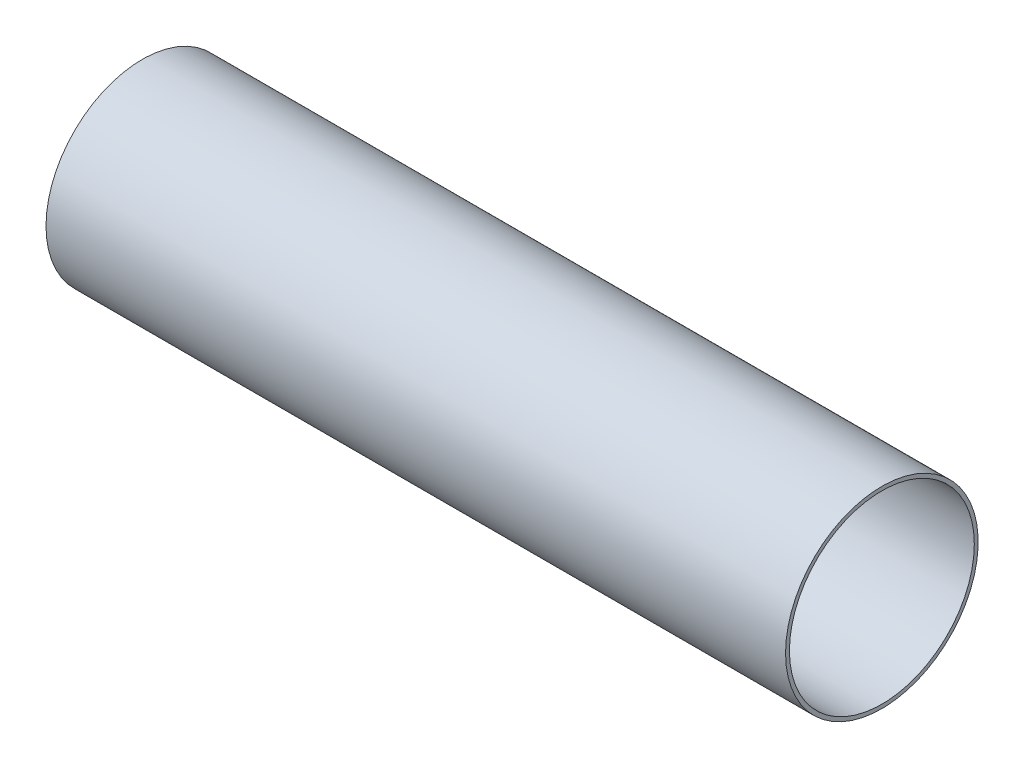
ISO-10303-21;
HEADER;
FILE_DESCRIPTION(('STEP AP214'),'2;1');
FILE_NAME('part.step','',(''),(''),'','','');
FILE_SCHEMA(('AUTOMOTIVE_DESIGN { 1 0 10303 214 1 1 1 1 }'));
ENDSEC;
DATA;
#1=APPLICATION_CONTEXT('core data for automotive mechanical design processes');
#2=APPLICATION_PROTOCOL_DEFINITION('international standard','automotive_design',2000,#1);
#3=PRODUCT_CONTEXT('',#1,'mechanical');
#4=PRODUCT('Part','Part','',(#3));
#5=PRODUCT_RELATED_PRODUCT_CATEGORY('part','',(#4));
#6=PRODUCT_DEFINITION_FORMATION('','',#4);
#7=PRODUCT_DEFINITION_CONTEXT('part definition',#1,'design');
#8=PRODUCT_DEFINITION('design','',#6,#7);
#9=PRODUCT_DEFINITION_SHAPE('','',#8);
#10=(LENGTH_UNIT() NAMED_UNIT(*) SI_UNIT(.MILLI.,.METRE.));
#11=(NAMED_UNIT(*) PLANE_ANGLE_UNIT() SI_UNIT($,.RADIAN.));
#12=(NAMED_UNIT(*) SI_UNIT($,.STERADIAN.) SOLID_ANGLE_UNIT());
#13=UNCERTAINTY_MEASURE_WITH_UNIT(LENGTH_MEASURE(1.E-05),#10,'distance_accuracy_value','');
#14=(GEOMETRIC_REPRESENTATION_CONTEXT(3) GLOBAL_UNCERTAINTY_ASSIGNED_CONTEXT((#13)) GLOBAL_UNIT_ASSIGNED_CONTEXT((#10,
#11,#12)) REPRESENTATION_CONTEXT('',''));
#15=CARTESIAN_POINT('',(0.,0.,0.));
#16=DIRECTION('',(0.,0.,1.));
#17=DIRECTION('',(1.,0.,0.));
#18=AXIS2_PLACEMENT_3D('',#15,#16,#17);
#19=CARTESIAN_POINT('',(304.8,0.,0.));
#20=DIRECTION('',(1.,0.,0.));
#21=DIRECTION('',(0.,0.,-1.));
#22=AXIS2_PLACEMENT_3D('',#19,#20,#21);
#23=PLANE('',#22);
#24=CARTESIAN_POINT('',(304.8,0.,0.));
#25=DIRECTION('',(1.,0.,0.));
#26=DIRECTION('',(0.,0.,-1.));
#27=AXIS2_PLACEMENT_3D('',#24,#25,#26);
#28=CIRCLE('',#27,39.6875);
#29=CARTESIAN_POINT('',(304.8,0.,39.6875));
#30=VERTEX_POINT('',#29);
#31=EDGE_CURVE('E10',#30,#30,#28,.T.);
#32=ORIENTED_EDGE('',*,*,#31,.T.);
#33=EDGE_LOOP('',(#32));
#34=FACE_BOUND('',#33,.T.);
#35=CARTESIAN_POINT('',(304.8,0.,0.));
#36=DIRECTION('',(1.,0.,0.));
#37=DIRECTION('',(0.,0.,-1.));
#38=AXIS2_PLACEMENT_3D('',#35,#36,#37);
#39=CIRCLE('',#38,38.1);
#40=CARTESIAN_POINT('',(304.8,0.,38.1));
#41=VERTEX_POINT('',#40);
#42=EDGE_CURVE('E39',#41,#41,#39,.T.);
#43=ORIENTED_EDGE('',*,*,#42,.F.);
#44=EDGE_LOOP('',(#43));
#45=FACE_BOUND('',#44,.T.);
#46=ADVANCED_FACE('F28',(#34,#45),#23,.T.);
#47=CARTESIAN_POINT('',(0.,0.,0.));
#48=DIRECTION('',(1.,0.,0.));
#49=DIRECTION('',(0.,0.,-1.));
#50=AXIS2_PLACEMENT_3D('',#47,#48,#49);
#51=PLANE('',#50);
#52=CARTESIAN_POINT('',(0.,0.,0.));
#53=DIRECTION('',(1.,0.,0.));
#54=DIRECTION('',(0.,0.,-1.));
#55=AXIS2_PLACEMENT_3D('',#52,#53,#54);
#56=CIRCLE('',#55,39.6875);
#57=CARTESIAN_POINT('',(0.,0.,39.6875));
#58=VERTEX_POINT('',#57);
#59=EDGE_CURVE('E35',#58,#58,#56,.T.);
#60=ORIENTED_EDGE('',*,*,#59,.F.);
#61=EDGE_LOOP('',(#60));
#62=FACE_BOUND('',#61,.T.);
#63=CARTESIAN_POINT('',(0.,0.,0.));
#64=DIRECTION('',(1.,0.,0.));
#65=DIRECTION('',(0.,0.,-1.));
#66=AXIS2_PLACEMENT_3D('',#63,#64,#65);
#67=CIRCLE('',#66,38.1);
#68=CARTESIAN_POINT('',(0.,0.,38.1));
#69=VERTEX_POINT('',#68);
#70=EDGE_CURVE('E43',#69,#69,#67,.T.);
#71=ORIENTED_EDGE('',*,*,#70,.T.);
#72=EDGE_LOOP('',(#71));
#73=FACE_BOUND('',#72,.T.);
#74=ADVANCED_FACE('F49',(#62,#73),#51,.F.);
#75=CARTESIAN_POINT('',(304.8,0.,0.));
#76=DIRECTION('',(-1.,0.,0.));
#77=DIRECTION('',(0.,0.,1.));
#78=AXIS2_PLACEMENT_3D('',#75,#76,#77);
#79=CYLINDRICAL_SURFACE('',#78,39.6875);
#80=CARTESIAN_POINT('',(304.8,0.,39.6875));
#81=CARTESIAN_POINT('',(301.625,0.,39.6875));
#82=CARTESIAN_POINT('',(298.45,0.,39.6875));
#83=CARTESIAN_POINT('',(292.1,0.,39.6875));
#84=CARTESIAN_POINT('',(288.925,0.,39.6875));
#85=CARTESIAN_POINT('',(282.575,0.,39.6875));
#86=CARTESIAN_POINT('',(279.4,0.,39.6875));
#87=CARTESIAN_POINT('',(273.05,0.,39.6875));
#88=CARTESIAN_POINT('',(269.875,0.,39.6875));
#89=CARTESIAN_POINT('',(263.525,0.,39.6875));
#90=CARTESIAN_POINT('',(260.35,0.,39.6875));
#91=CARTESIAN_POINT('',(254.,0.,39.6875));
#92=CARTESIAN_POINT('',(250.825,0.,39.6875));
#93=CARTESIAN_POINT('',(244.475,0.,39.6875));
#94=CARTESIAN_POINT('',(241.3,0.,39.6875));
#95=CARTESIAN_POINT('',(234.95,0.,39.6875));
#96=CARTESIAN_POINT('',(231.775,0.,39.6875));
#97=CARTESIAN_POINT('',(225.425,0.,39.6875));
#98=CARTESIAN_POINT('',(222.25,0.,39.6875));
#99=CARTESIAN_POINT('',(215.9,0.,39.6875));
#100=CARTESIAN_POINT('',(212.725,0.,39.6875));
#101=CARTESIAN_POINT('',(206.375,0.,39.6875));
#102=CARTESIAN_POINT('',(203.2,0.,39.6875));
#103=CARTESIAN_POINT('',(196.85,0.,39.6875));
#104=CARTESIAN_POINT('',(193.675,0.,39.6875));
#105=CARTESIAN_POINT('',(187.325,0.,39.6875));
#106=CARTESIAN_POINT('',(184.15,0.,39.6875));
#107=CARTESIAN_POINT('',(177.8,0.,39.6875));
#108=CARTESIAN_POINT('',(174.625,0.,39.6875));
#109=CARTESIAN_POINT('',(168.275,0.,39.6875));
#110=CARTESIAN_POINT('',(165.1,0.,39.6875));
#111=CARTESIAN_POINT('',(158.75,0.,39.6875));
#112=CARTESIAN_POINT('',(155.575,0.,39.6875));
#113=CARTESIAN_POINT('',(149.225,0.,39.6875));
#114=CARTESIAN_POINT('',(146.05,0.,39.6875));
#115=CARTESIAN_POINT('',(139.7,0.,39.6875));
#116=CARTESIAN_POINT('',(136.525,0.,39.6875));
#117=CARTESIAN_POINT('',(130.175,0.,39.6875));
#118=CARTESIAN_POINT('',(127.,0.,39.6875));
#119=CARTESIAN_POINT('',(120.65,0.,39.6875));
#120=CARTESIAN_POINT('',(117.475,0.,39.6875));
#121=CARTESIAN_POINT('',(111.125,0.,39.6875));
#122=CARTESIAN_POINT('',(107.95,0.,39.6875));
#123=CARTESIAN_POINT('',(101.6,0.,39.6875));
#124=CARTESIAN_POINT('',(98.425,0.,39.6875));
#125=CARTESIAN_POINT('',(92.075,0.,39.6875));
#126=CARTESIAN_POINT('',(88.9,0.,39.6875));
#127=CARTESIAN_POINT('',(82.55,0.,39.6875));
#128=CARTESIAN_POINT('',(79.375,0.,39.6875));
#129=CARTESIAN_POINT('',(73.025,0.,39.6875));
#130=CARTESIAN_POINT('',(69.85,0.,39.6875));
#131=CARTESIAN_POINT('',(63.5,0.,39.6875));
#132=CARTESIAN_POINT('',(60.325,0.,39.6875));
#133=CARTESIAN_POINT('',(53.975,0.,39.6875));
#134=CARTESIAN_POINT('',(50.8,0.,39.6875));
#135=CARTESIAN_POINT('',(44.45,0.,39.6875));
#136=CARTESIAN_POINT('',(41.275,0.,39.6875));
#137=CARTESIAN_POINT('',(34.925,0.,39.6875));
#138=CARTESIAN_POINT('',(31.75,0.,39.6875));
#139=CARTESIAN_POINT('',(25.4,0.,39.6875));
#140=CARTESIAN_POINT('',(22.225,0.,39.6875));
#141=CARTESIAN_POINT('',(15.875,0.,39.6875));
#142=CARTESIAN_POINT('',(12.7,0.,39.6875));
#143=CARTESIAN_POINT('',(6.35,0.,39.6875));
#144=CARTESIAN_POINT('',(3.175,0.,39.6875));
#145=CARTESIAN_POINT('',(0.,0.,39.6875));
#146=B_SPLINE_CURVE_WITH_KNOTS('',3,(#80,#81,#82,#83,#84,#85,#86,#87,#88,#89,#90,#91,#92,#93,
#94,#95,#96,#97,#98,#99,#100,#101,#102,#103,#104,#105,#106,#107,#108,#109,#110,#111,#112,#113,
#114,#115,#116,#117,#118,#119,#120,#121,#122,#123,#124,#125,#126,#127,#128,#129,#130,#131,#132,
#133,#134,#135,#136,#137,#138,#139,#140,#141,#142,#143,#144,#145),.UNSPECIFIED.,.F.,.F.,(4,2,2,
2,2,2,2,2,2,2,2,2,2,2,2,2,2,2,2,2,2,2,2,2,2,2,2,2,2,2,2,2,4),(0.,9.52499999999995,19.05,28.575,
38.1,47.625,57.15,66.675,76.2,85.725,95.2499999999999,104.775,114.3,123.825,133.35,142.875,
152.4,161.925,171.45,180.975,190.5,200.025,209.55,219.075,228.6,238.125,247.65,257.175,266.7,
276.225,285.75,295.275,304.8),.UNSPECIFIED.);
#147=EDGE_CURVE('BSEAM30',#30,#58,#146,.T.);
#148=ORIENTED_EDGE('',*,*,#31,.F.);
#149=ORIENTED_EDGE('',*,*,#59,.T.);
#150=ORIENTED_EDGE('',*,*,#147,.T.);
#151=ORIENTED_EDGE('',*,*,#147,.F.);
#152=EDGE_LOOP('',(#148,#150,#149,#151));
#153=FACE_BOUND('',#152,.T.);
#154=ADVANCED_FACE('F30',(#153),#79,.T.);
#155=CARTESIAN_POINT('',(304.8,0.,0.));
#156=DIRECTION('',(-1.,0.,0.));
#157=DIRECTION('',(0.,0.,1.));
#158=AXIS2_PLACEMENT_3D('',#155,#156,#157);
#159=CYLINDRICAL_SURFACE('',#158,38.1);
#160=CARTESIAN_POINT('',(304.8,0.,38.1));
#161=CARTESIAN_POINT('',(301.625,0.,38.1));
#162=CARTESIAN_POINT('',(298.45,0.,38.1));
#163=CARTESIAN_POINT('',(292.1,0.,38.1));
#164=CARTESIAN_POINT('',(288.925,0.,38.1));
#165=CARTESIAN_POINT('',(282.575,0.,38.1));
#166=CARTESIAN_POINT('',(279.4,0.,38.1));
#167=CARTESIAN_POINT('',(273.05,0.,38.1));
#168=CARTESIAN_POINT('',(269.875,0.,38.1));
#169=CARTESIAN_POINT('',(263.525,0.,38.1));
#170=CARTESIAN_POINT('',(260.35,0.,38.1));
#171=CARTESIAN_POINT('',(254.,0.,38.1));
#172=CARTESIAN_POINT('',(250.825,0.,38.1));
#173=CARTESIAN_POINT('',(244.475,0.,38.1));
#174=CARTESIAN_POINT('',(241.3,0.,38.1));
#175=CARTESIAN_POINT('',(234.95,0.,38.1));
#176=CARTESIAN_POINT('',(231.775,0.,38.1));
#177=CARTESIAN_POINT('',(225.425,0.,38.1));
#178=CARTESIAN_POINT('',(222.25,0.,38.1));
#179=CARTESIAN_POINT('',(215.9,0.,38.1));
#180=CARTESIAN_POINT('',(212.725,0.,38.1));
#181=CARTESIAN_POINT('',(206.375,0.,38.1));
#182=CARTESIAN_POINT('',(203.2,0.,38.1));
#183=CARTESIAN_POINT('',(196.85,0.,38.1));
#184=CARTESIAN_POINT('',(193.675,0.,38.1));
#185=CARTESIAN_POINT('',(187.325,0.,38.1));
#186=CARTESIAN_POINT('',(184.15,0.,38.1));
#187=CARTESIAN_POINT('',(177.8,0.,38.1));
#188=CARTESIAN_POINT('',(174.625,0.,38.1));
#189=CARTESIAN_POINT('',(168.275,0.,38.1));
#190=CARTESIAN_POINT('',(165.1,0.,38.1));
#191=CARTESIAN_POINT('',(158.75,0.,38.1));
#192=CARTESIAN_POINT('',(155.575,0.,38.1));
#193=CARTESIAN_POINT('',(149.225,0.,38.1));
#194=CARTESIAN_POINT('',(146.05,0.,38.1));
#195=CARTESIAN_POINT('',(139.7,0.,38.1));
#196=CARTESIAN_POINT('',(136.525,0.,38.1));
#197=CARTESIAN_POINT('',(130.175,0.,38.1));
#198=CARTESIAN_POINT('',(127.,0.,38.1));
#199=CARTESIAN_POINT('',(120.65,0.,38.1));
#200=CARTESIAN_POINT('',(117.475,0.,38.1));
#201=CARTESIAN_POINT('',(111.125,0.,38.1));
#202=CARTESIAN_POINT('',(107.95,0.,38.1));
#203=CARTESIAN_POINT('',(101.6,0.,38.1));
#204=CARTESIAN_POINT('',(98.425,0.,38.1));
#205=CARTESIAN_POINT('',(92.075,0.,38.1));
#206=CARTESIAN_POINT('',(88.9,0.,38.1));
#207=CARTESIAN_POINT('',(82.55,0.,38.1));
#208=CARTESIAN_POINT('',(79.375,0.,38.1));
#209=CARTESIAN_POINT('',(73.025,0.,38.1));
#210=CARTESIAN_POINT('',(69.85,0.,38.1));
#211=CARTESIAN_POINT('',(63.5,0.,38.1));
#212=CARTESIAN_POINT('',(60.325,0.,38.1));
#213=CARTESIAN_POINT('',(53.975,0.,38.1));
#214=CARTESIAN_POINT('',(50.8,0.,38.1));
#215=CARTESIAN_POINT('',(44.45,0.,38.1));
#216=CARTESIAN_POINT('',(41.275,0.,38.1));
#217=CARTESIAN_POINT('',(34.925,0.,38.1));
#218=CARTESIAN_POINT('',(31.75,0.,38.1));
#219=CARTESIAN_POINT('',(25.4,0.,38.1));
#220=CARTESIAN_POINT('',(22.225,0.,38.1));
#221=CARTESIAN_POINT('',(15.875,0.,38.1));
#222=CARTESIAN_POINT('',(12.7,0.,38.1));
#223=CARTESIAN_POINT('',(6.35,0.,38.1));
#224=CARTESIAN_POINT('',(3.175,0.,38.1));
#225=CARTESIAN_POINT('',(0.,0.,38.1));
#226=B_SPLINE_CURVE_WITH_KNOTS('',3,(#160,#161,#162,#163,#164,#165,#166,#167,#168,#169,#170,
#171,#172,#173,#174,#175,#176,#177,#178,#179,#180,#181,#182,#183,#184,#185,#186,#187,#188,#189,
#190,#191,#192,#193,#194,#195,#196,#197,#198,#199,#200,#201,#202,#203,#204,#205,#206,#207,#208,
#209,#210,#211,#212,#213,#214,#215,#216,#217,#218,#219,#220,#221,#222,#223,#224,#225),
.UNSPECIFIED.,.F.,.F.,(4,2,2,2,2,2,2,2,2,2,2,2,2,2,2,2,2,2,2,2,2,2,2,2,2,2,2,2,2,2,2,2,4),(0.,
9.52500000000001,19.05,28.575,38.1,47.625,57.15,66.675,76.2,85.7250000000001,95.2500000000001,
104.775,114.3,123.825,133.35,142.875,152.4,161.925,171.45,180.975,190.5,200.025,209.55,219.075,
228.6,238.125,247.65,257.175,266.7,276.225,285.75,295.275,304.8),.UNSPECIFIED.);
#227=EDGE_CURVE('BSEAM51',#41,#69,#226,.T.);
#228=ORIENTED_EDGE('',*,*,#42,.T.);
#229=ORIENTED_EDGE('',*,*,#70,.F.);
#230=ORIENTED_EDGE('',*,*,#227,.T.);
#231=ORIENTED_EDGE('',*,*,#227,.F.);
#232=EDGE_LOOP('',(#228,#230,#229,#231));
#233=FACE_BOUND('',#232,.T.);
#234=ADVANCED_FACE('F51',(#233),#159,.F.);
#235=CLOSED_SHELL('',(#46,#74,#154,#234));
#236=MANIFOLD_SOLID_BREP('B2',#235);
#237=ADVANCED_BREP_SHAPE_REPRESENTATION('',(#18,#236),#14);
#238=SHAPE_DEFINITION_REPRESENTATION(#9,#237);
ENDSEC;
END-ISO-10303-21;
